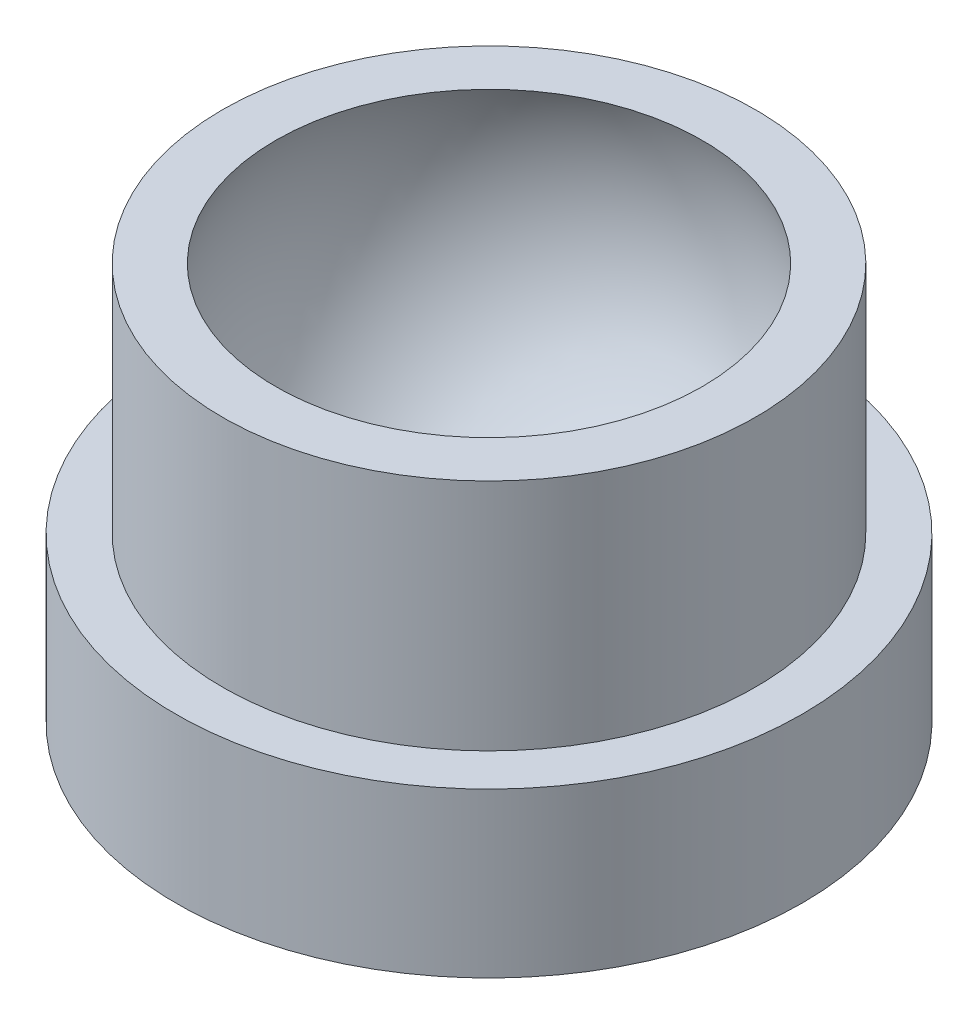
ISO-10303-21;
HEADER;
FILE_DESCRIPTION(('STEP AP214'),'2;1');
FILE_NAME('part.step','',(''),(''),'','','');
FILE_SCHEMA(('AUTOMOTIVE_DESIGN { 1 0 10303 214 1 1 1 1 }'));
ENDSEC;
DATA;
#1=APPLICATION_CONTEXT('core data for automotive mechanical design processes');
#2=APPLICATION_PROTOCOL_DEFINITION('international standard','automotive_design',2000,#1);
#3=PRODUCT_CONTEXT('',#1,'mechanical');
#4=PRODUCT('Part','Part','',(#3));
#5=PRODUCT_RELATED_PRODUCT_CATEGORY('part','',(#4));
#6=PRODUCT_DEFINITION_FORMATION('','',#4);
#7=PRODUCT_DEFINITION_CONTEXT('part definition',#1,'design');
#8=PRODUCT_DEFINITION('design','',#6,#7);
#9=PRODUCT_DEFINITION_SHAPE('','',#8);
#10=(LENGTH_UNIT() NAMED_UNIT(*) SI_UNIT(.MILLI.,.METRE.));
#11=(NAMED_UNIT(*) PLANE_ANGLE_UNIT() SI_UNIT($,.RADIAN.));
#12=(NAMED_UNIT(*) SI_UNIT($,.STERADIAN.) SOLID_ANGLE_UNIT());
#13=UNCERTAINTY_MEASURE_WITH_UNIT(LENGTH_MEASURE(1.E-05),#10,'distance_accuracy_value','');
#14=(GEOMETRIC_REPRESENTATION_CONTEXT(3) GLOBAL_UNCERTAINTY_ASSIGNED_CONTEXT((#13)) GLOBAL_UNIT_ASSIGNED_CONTEXT((#10,
#11,#12)) REPRESENTATION_CONTEXT('',''));
#15=CARTESIAN_POINT('',(0.,0.,0.));
#16=DIRECTION('',(0.,0.,1.));
#17=DIRECTION('',(1.,0.,0.));
#18=AXIS2_PLACEMENT_3D('',#15,#16,#17);
#19=CARTESIAN_POINT('',(0.,12.7,0.));
#20=DIRECTION('',(0.,1.,0.));
#21=DIRECTION('',(-1.,0.,0.));
#22=AXIS2_PLACEMENT_3D('',#19,#20,#21);
#23=PLANE('',#22);
#24=CARTESIAN_POINT('',(17.018,12.7,0.));
#25=DIRECTION('',(0.,1.,0.));
#26=DIRECTION('',(-1.,0.,0.));
#27=AXIS2_PLACEMENT_3D('',#24,#25,#26);
#28=CIRCLE('',#27,11.5914745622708);
#29=CARTESIAN_POINT('',(5.42652543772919,12.7,0.));
#30=VERTEX_POINT('',#29);
#31=EDGE_CURVE('E34',#30,#30,#28,.F.);
#32=ORIENTED_EDGE('',*,*,#31,.T.);
#33=EDGE_LOOP('',(#32));
#34=FACE_BOUND('',#33,.T.);
#35=CARTESIAN_POINT('',(17.018,12.7,0.));
#36=DIRECTION('',(0.,1.,0.));
#37=DIRECTION('',(-1.,0.,0.));
#38=AXIS2_PLACEMENT_3D('',#35,#36,#37);
#39=CIRCLE('',#38,14.478);
#40=CARTESIAN_POINT('',(2.54,12.7,0.));
#41=VERTEX_POINT('',#40);
#42=EDGE_CURVE('E47',#41,#41,#39,.T.);
#43=ORIENTED_EDGE('',*,*,#42,.T.);
#44=EDGE_LOOP('',(#43));
#45=FACE_BOUND('',#44,.T.);
#46=ADVANCED_FACE('F31',(#34,#45),#23,.T.);
#47=CARTESIAN_POINT('',(0.,-8.89,0.));
#48=DIRECTION('',(0.,-1.,0.));
#49=DIRECTION('',(1.,0.,0.));
#50=AXIS2_PLACEMENT_3D('',#47,#48,#49);
#51=PLANE('',#50);
#52=CARTESIAN_POINT('',(17.018,-8.89,0.));
#53=DIRECTION('',(0.,1.,0.));
#54=DIRECTION('',(-1.,0.,0.));
#55=AXIS2_PLACEMENT_3D('',#52,#53,#54);
#56=CIRCLE('',#55,17.018);
#57=CARTESIAN_POINT('',(0.,-8.89,0.));
#58=VERTEX_POINT('',#57);
#59=EDGE_CURVE('E10',#58,#58,#56,.T.);
#60=ORIENTED_EDGE('',*,*,#59,.F.);
#61=EDGE_LOOP('',(#60));
#62=FACE_BOUND('',#61,.T.);
#63=ADVANCED_FACE('F66',(#62),#51,.T.);
#64=CARTESIAN_POINT('',(17.018,12.7,0.));
#65=DIRECTION('',(0.,1.,0.));
#66=DIRECTION('',(-1.,0.,0.));
#67=AXIS2_PLACEMENT_3D('',#64,#65,#66);
#68=CYLINDRICAL_SURFACE('',#67,17.018);
#69=ORIENTED_EDGE('',*,*,#59,.T.);
#70=EDGE_LOOP('',(#69));
#71=FACE_BOUND('',#70,.T.);
#72=CARTESIAN_POINT('',(17.018,0.,0.));
#73=DIRECTION('',(0.,1.,0.));
#74=DIRECTION('',(-1.,0.,0.));
#75=AXIS2_PLACEMENT_3D('',#72,#73,#74);
#76=CIRCLE('',#75,17.018);
#77=CARTESIAN_POINT('',(0.,0.,0.));
#78=VERTEX_POINT('',#77);
#79=EDGE_CURVE('E38',#78,#78,#76,.T.);
#80=ORIENTED_EDGE('',*,*,#79,.F.);
#81=EDGE_LOOP('',(#80));
#82=FACE_BOUND('',#81,.T.);
#83=ADVANCED_FACE('F70',(#71,#82),#68,.T.);
#84=CARTESIAN_POINT('',(0.,0.,0.));
#85=DIRECTION('',(0.,1.,0.));
#86=DIRECTION('',(-1.,0.,0.));
#87=AXIS2_PLACEMENT_3D('',#84,#85,#86);
#88=PLANE('',#87);
#89=ORIENTED_EDGE('',*,*,#79,.T.);
#90=EDGE_LOOP('',(#89));
#91=FACE_BOUND('',#90,.T.);
#92=CARTESIAN_POINT('',(17.018,0.,0.));
#93=DIRECTION('',(0.,1.,0.));
#94=DIRECTION('',(-1.,0.,0.));
#95=AXIS2_PLACEMENT_3D('',#92,#93,#94);
#96=CIRCLE('',#95,14.478);
#97=CARTESIAN_POINT('',(2.54000000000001,0.,0.));
#98=VERTEX_POINT('',#97);
#99=EDGE_CURVE('E42',#98,#98,#96,.T.);
#100=ORIENTED_EDGE('',*,*,#99,.F.);
#101=EDGE_LOOP('',(#100));
#102=FACE_BOUND('',#101,.T.);
#103=ADVANCED_FACE('F62',(#91,#102),#88,.T.);
#104=CARTESIAN_POINT('',(17.018,12.7,0.));
#105=DIRECTION('',(0.,1.,0.));
#106=DIRECTION('',(-1.,0.,0.));
#107=AXIS2_PLACEMENT_3D('',#104,#105,#106);
#108=CYLINDRICAL_SURFACE('',#107,14.478);
#109=ORIENTED_EDGE('',*,*,#99,.T.);
#110=EDGE_LOOP('',(#109));
#111=FACE_BOUND('',#110,.T.);
#112=ORIENTED_EDGE('',*,*,#42,.F.);
#113=EDGE_LOOP('',(#112));
#114=FACE_BOUND('',#113,.T.);
#115=ADVANCED_FACE('F57',(#111,#114),#108,.T.);
#116=CARTESIAN_POINT('',(17.018,7.51080762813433,0.));
#117=DIRECTION('',(-1.,0.,0.));
#118=DIRECTION('',(0.,1.,0.));
#119=AXIS2_PLACEMENT_3D('',#116,#117,#118);
#120=SPHERICAL_SURFACE('',#119,12.7);
#121=CARTESIAN_POINT('',(17.018,7.51080762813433,0.));
#122=DIRECTION('',(0.,1.,0.));
#123=DIRECTION('',(-1.,0.,0.));
#124=AXIS2_PLACEMENT_3D('',#121,#122,#123);
#125=SPHERICAL_SURFACE('',#124,12.7);
#126=ORIENTED_EDGE('',*,*,#31,.F.);
#127=EDGE_LOOP('',(#126));
#128=FACE_BOUND('',#127,.T.);
#129=ADVANCED_FACE('F55',(#128),#125,.F.);
#130=CLOSED_SHELL('',(#46,#63,#83,#103,#115,#129));
#131=MANIFOLD_SOLID_BREP('B2',#130);
#132=ADVANCED_BREP_SHAPE_REPRESENTATION('',(#18,#131),#14);
#133=SHAPE_DEFINITION_REPRESENTATION(#9,#132);
ENDSEC;
END-ISO-10303-21;
